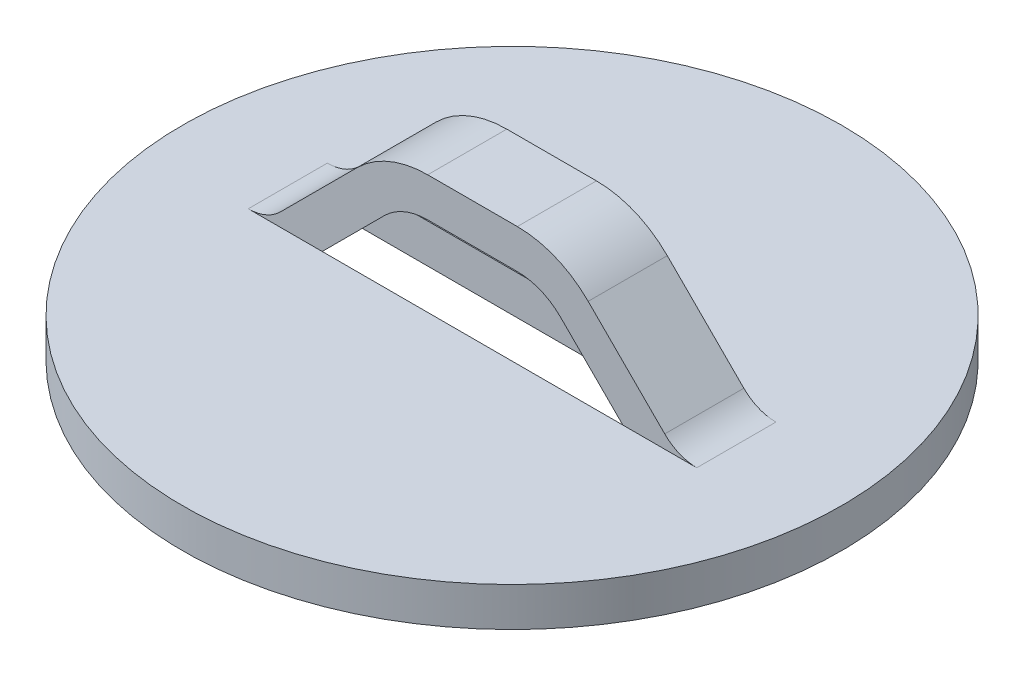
ISO-10303-21;
HEADER;
FILE_DESCRIPTION(('STEP AP214'),'2;1');
FILE_NAME('part.step','',(''),(''),'','','');
FILE_SCHEMA(('AUTOMOTIVE_DESIGN { 1 0 10303 214 1 1 1 1 }'));
ENDSEC;
DATA;
#1=APPLICATION_CONTEXT('core data for automotive mechanical design processes');
#2=APPLICATION_PROTOCOL_DEFINITION('international standard','automotive_design',2000,#1);
#3=PRODUCT_CONTEXT('',#1,'mechanical');
#4=PRODUCT('Part','Part','',(#3));
#5=PRODUCT_RELATED_PRODUCT_CATEGORY('part','',(#4));
#6=PRODUCT_DEFINITION_FORMATION('','',#4);
#7=PRODUCT_DEFINITION_CONTEXT('part definition',#1,'design');
#8=PRODUCT_DEFINITION('design','',#6,#7);
#9=PRODUCT_DEFINITION_SHAPE('','',#8);
#10=(LENGTH_UNIT() NAMED_UNIT(*) SI_UNIT(.MILLI.,.METRE.));
#11=(NAMED_UNIT(*) PLANE_ANGLE_UNIT() SI_UNIT($,.RADIAN.));
#12=(NAMED_UNIT(*) SI_UNIT($,.STERADIAN.) SOLID_ANGLE_UNIT());
#13=UNCERTAINTY_MEASURE_WITH_UNIT(LENGTH_MEASURE(1.E-05),#10,'distance_accuracy_value','');
#14=(GEOMETRIC_REPRESENTATION_CONTEXT(3) GLOBAL_UNCERTAINTY_ASSIGNED_CONTEXT((#13)) GLOBAL_UNIT_ASSIGNED_CONTEXT((#10,
#11,#12)) REPRESENTATION_CONTEXT('',''));
#15=CARTESIAN_POINT('',(0.,0.,0.));
#16=DIRECTION('',(0.,0.,1.));
#17=DIRECTION('',(1.,0.,0.));
#18=AXIS2_PLACEMENT_3D('',#15,#16,#17);
#19=CARTESIAN_POINT('',(-11.6166532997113,2.1844,3.81));
#20=DIRECTION('',(0.,0.,-1.));
#21=DIRECTION('',(-1.,0.,0.));
#22=AXIS2_PLACEMENT_3D('',#19,#20,#21);
#23=PLANE('',#22);
#24=DIRECTION('',(-1.,0.,0.));
#25=VECTOR('',#24,1.);
#26=CARTESIAN_POINT('',(-11.6166532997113,0.,3.81));
#27=LINE('',#26,#25);
#28=CARTESIAN_POINT('',(9.98975221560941,0.,3.81));
#29=VERTEX_POINT('',#28);
#30=CARTESIAN_POINT('',(6.42678829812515,0.,3.81));
#31=VERTEX_POINT('',#30);
#32=EDGE_CURVE('E343',#29,#31,#27,.T.);
#33=ORIENTED_EDGE('',*,*,#32,.F.);
#34=CARTESIAN_POINT('',(9.98975221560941,2.1844,3.81));
#35=DIRECTION('',(0.,0.,-1.));
#36=DIRECTION('',(1.,0.,0.));
#37=AXIS2_PLACEMENT_3D('',#34,#35,#36);
#38=CIRCLE('',#37,2.1844);
#39=CARTESIAN_POINT('',(8.44514816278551,0.639795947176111,3.81));
#40=VERTEX_POINT('',#39);
#41=EDGE_CURVE('E279',#29,#40,#38,.T.);
#42=ORIENTED_EDGE('',*,*,#41,.T.);
#43=DIRECTION('',(-0.707106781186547,0.707106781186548,0.));
#44=VECTOR('',#43,1.);
#45=CARTESIAN_POINT('',(8.44514816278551,0.639795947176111,3.81));
#46=LINE('',#45,#44);
#47=CARTESIAN_POINT('',(4.75804678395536,4.32689732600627,3.81));
#48=VERTEX_POINT('',#47);
#49=EDGE_CURVE('E281',#40,#48,#46,.T.);
#50=ORIENTED_EDGE('',*,*,#49,.T.);
#51=CARTESIAN_POINT('',(1.34554945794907,0.914400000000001,3.81));
#52=DIRECTION('',(0.,0.,1.));
#53=DIRECTION('',(-1.,0.,0.));
#54=AXIS2_PLACEMENT_3D('',#51,#52,#53);
#55=CIRCLE('',#54,4.826);
#56=CARTESIAN_POINT('',(1.34554945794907,5.7404,3.81));
#57=VERTEX_POINT('',#56);
#58=EDGE_CURVE('E283',#48,#57,#55,.T.);
#59=ORIENTED_EDGE('',*,*,#58,.T.);
#60=DIRECTION('',(-1.,0.,0.));
#61=VECTOR('',#60,1.);
#62=CARTESIAN_POINT('',(-2.97245054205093,5.7404,3.81));
#63=LINE('',#62,#61);
#64=CARTESIAN_POINT('',(-2.97245054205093,5.7404,3.81));
#65=VERTEX_POINT('',#64);
#66=EDGE_CURVE('E285',#57,#65,#63,.T.);
#67=ORIENTED_EDGE('',*,*,#66,.T.);
#68=CARTESIAN_POINT('',(-2.97245054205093,0.9144,3.81));
#69=DIRECTION('',(0.,0.,1.));
#70=DIRECTION('',(1.,0.,0.));
#71=AXIS2_PLACEMENT_3D('',#68,#69,#70);
#72=CIRCLE('',#71,4.826);
#73=CARTESIAN_POINT('',(-6.38494786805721,4.32689732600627,3.81));
#74=VERTEX_POINT('',#73);
#75=EDGE_CURVE('E287',#65,#74,#72,.T.);
#76=ORIENTED_EDGE('',*,*,#75,.T.);
#77=DIRECTION('',(-0.707106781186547,-0.707106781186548,0.));
#78=VECTOR('',#77,1.);
#79=CARTESIAN_POINT('',(-10.0720492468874,0.639795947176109,3.81));
#80=LINE('',#79,#78);
#81=CARTESIAN_POINT('',(-10.0720492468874,0.639795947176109,3.81));
#82=VERTEX_POINT('',#81);
#83=EDGE_CURVE('E197',#74,#82,#80,.T.);
#84=ORIENTED_EDGE('',*,*,#83,.T.);
#85=CARTESIAN_POINT('',(-11.6166532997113,2.1844,3.81));
#86=DIRECTION('',(0.,0.,-1.));
#87=DIRECTION('',(-1.,0.,0.));
#88=AXIS2_PLACEMENT_3D('',#85,#86,#87);
#89=CIRCLE('',#88,2.1844);
#90=CARTESIAN_POINT('',(-11.6166532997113,0.,3.81));
#91=VERTEX_POINT('',#90);
#92=EDGE_CURVE('E193',#82,#91,#89,.T.);
#93=ORIENTED_EDGE('',*,*,#92,.T.);
#94=CARTESIAN_POINT('',(-8.053689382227,0.,3.81));
#95=VERTEX_POINT('',#94);
#96=EDGE_CURVE('E60',#95,#91,#27,.T.);
#97=ORIENTED_EDGE('',*,*,#96,.F.);
#98=DIRECTION('',(0.707106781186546,0.707106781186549,0.));
#99=VECTOR('',#98,1.);
#100=CARTESIAN_POINT('',(-8.74297134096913,-0.689281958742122,3.81));
#101=LINE('',#100,#99);
#102=CARTESIAN_POINT('',(-5.05586996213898,2.99781942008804,3.81));
#103=VERTEX_POINT('',#102);
#104=EDGE_CURVE('E267',#95,#103,#101,.T.);
#105=ORIENTED_EDGE('',*,*,#104,.T.);
#106=CARTESIAN_POINT('',(-2.97245054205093,0.9144,3.81));
#107=DIRECTION('',(0.,0.,-1.));
#108=DIRECTION('',(1.,0.,0.));
#109=AXIS2_PLACEMENT_3D('',#106,#107,#108);
#110=CIRCLE('',#109,2.9464);
#111=CARTESIAN_POINT('',(-2.97245054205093,3.8608,3.81));
#112=VERTEX_POINT('',#111);
#113=EDGE_CURVE('E270',#103,#112,#110,.T.);
#114=ORIENTED_EDGE('',*,*,#113,.T.);
#115=DIRECTION('',(1.,0.,0.));
#116=VECTOR('',#115,1.);
#117=CARTESIAN_POINT('',(-2.97245054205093,3.8608,3.81));
#118=LINE('',#117,#116);
#119=CARTESIAN_POINT('',(1.34554945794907,3.8608,3.81));
#120=VERTEX_POINT('',#119);
#121=EDGE_CURVE('E272',#112,#120,#118,.T.);
#122=ORIENTED_EDGE('',*,*,#121,.T.);
#123=CARTESIAN_POINT('',(1.34554945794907,0.914400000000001,3.81));
#124=DIRECTION('',(0.,0.,-1.));
#125=DIRECTION('',(-1.,0.,0.));
#126=AXIS2_PLACEMENT_3D('',#123,#124,#125);
#127=CIRCLE('',#126,2.9464);
#128=CARTESIAN_POINT('',(3.42896887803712,2.99781942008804,3.81));
#129=VERTEX_POINT('',#128);
#130=EDGE_CURVE('E274',#120,#129,#127,.T.);
#131=ORIENTED_EDGE('',*,*,#130,.T.);
#132=DIRECTION('',(0.707106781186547,-0.707106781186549,0.));
#133=VECTOR('',#132,1.);
#134=CARTESIAN_POINT('',(7.11607025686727,-0.689281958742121,3.81));
#135=LINE('',#134,#133);
#136=EDGE_CURVE('E276',#129,#31,#135,.T.);
#137=ORIENTED_EDGE('',*,*,#136,.T.);
#138=EDGE_LOOP('',(#33,#42,#50,#59,#67,#76,#84,#93,#97,#105,#114,#122,#131,#137));
#139=FACE_BOUND('',#138,.T.);
#140=ADVANCED_FACE('F37',(#139),#23,.F.);
#141=CARTESIAN_POINT('',(-11.6166532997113,2.1844,0.));
#142=DIRECTION('',(0.,0.,-1.));
#143=DIRECTION('',(-1.,0.,0.));
#144=AXIS2_PLACEMENT_3D('',#141,#142,#143);
#145=PLANE('',#144);
#146=CARTESIAN_POINT('',(9.98975221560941,2.1844,0.));
#147=DIRECTION('',(0.,0.,-1.));
#148=DIRECTION('',(1.,0.,0.));
#149=AXIS2_PLACEMENT_3D('',#146,#147,#148);
#150=CIRCLE('',#149,2.1844);
#151=CARTESIAN_POINT('',(9.98975221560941,0.,0.));
#152=VERTEX_POINT('',#151);
#153=CARTESIAN_POINT('',(8.44514816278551,0.639795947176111,0.));
#154=VERTEX_POINT('',#153);
#155=EDGE_CURVE('E306',#152,#154,#150,.T.);
#156=ORIENTED_EDGE('',*,*,#155,.F.);
#157=DIRECTION('',(-1.,0.,0.));
#158=VECTOR('',#157,1.);
#159=CARTESIAN_POINT('',(-11.6166532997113,0.,0.));
#160=LINE('',#159,#158);
#161=CARTESIAN_POINT('',(6.42678829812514,0.,0.));
#162=VERTEX_POINT('',#161);
#163=EDGE_CURVE('E11',#152,#162,#160,.T.);
#164=ORIENTED_EDGE('',*,*,#163,.T.);
#165=DIRECTION('',(0.707106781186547,-0.707106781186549,0.));
#166=VECTOR('',#165,1.);
#167=CARTESIAN_POINT('',(7.11607025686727,-0.689281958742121,0.));
#168=LINE('',#167,#166);
#169=CARTESIAN_POINT('',(3.42896887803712,2.99781942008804,0.));
#170=VERTEX_POINT('',#169);
#171=EDGE_CURVE('E300',#170,#162,#168,.T.);
#172=ORIENTED_EDGE('',*,*,#171,.F.);
#173=CARTESIAN_POINT('',(1.34554945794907,0.914400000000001,0.));
#174=DIRECTION('',(0.,0.,-1.));
#175=DIRECTION('',(-1.,0.,0.));
#176=AXIS2_PLACEMENT_3D('',#173,#174,#175);
#177=CIRCLE('',#176,2.9464);
#178=CARTESIAN_POINT('',(1.34554945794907,3.8608,0.));
#179=VERTEX_POINT('',#178);
#180=EDGE_CURVE('E297',#179,#170,#177,.T.);
#181=ORIENTED_EDGE('',*,*,#180,.F.);
#182=DIRECTION('',(1.,0.,0.));
#183=VECTOR('',#182,1.);
#184=CARTESIAN_POINT('',(-2.97245054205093,3.8608,0.));
#185=LINE('',#184,#183);
#186=CARTESIAN_POINT('',(-2.97245054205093,3.8608,0.));
#187=VERTEX_POINT('',#186);
#188=EDGE_CURVE('E295',#187,#179,#185,.T.);
#189=ORIENTED_EDGE('',*,*,#188,.F.);
#190=CARTESIAN_POINT('',(-2.97245054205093,0.9144,0.));
#191=DIRECTION('',(0.,0.,-1.));
#192=DIRECTION('',(1.,0.,0.));
#193=AXIS2_PLACEMENT_3D('',#190,#191,#192);
#194=CIRCLE('',#193,2.9464);
#195=CARTESIAN_POINT('',(-5.05586996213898,2.99781942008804,0.));
#196=VERTEX_POINT('',#195);
#197=EDGE_CURVE('E293',#196,#187,#194,.T.);
#198=ORIENTED_EDGE('',*,*,#197,.F.);
#199=DIRECTION('',(0.707106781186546,0.707106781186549,0.));
#200=VECTOR('',#199,1.);
#201=CARTESIAN_POINT('',(-8.74297134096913,-0.689281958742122,0.));
#202=LINE('',#201,#200);
#203=CARTESIAN_POINT('',(-8.05368938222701,0.,0.));
#204=VERTEX_POINT('',#203);
#205=EDGE_CURVE('E171',#204,#196,#202,.T.);
#206=ORIENTED_EDGE('',*,*,#205,.F.);
#207=DIRECTION('',(1.,0.,0.));
#208=VECTOR('',#207,1.);
#209=CARTESIAN_POINT('',(-11.6166532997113,0.,0.));
#210=LINE('',#209,#208);
#211=CARTESIAN_POINT('',(-11.6166532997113,0.,0.));
#212=VERTEX_POINT('',#211);
#213=EDGE_CURVE('E164',#212,#204,#210,.T.);
#214=ORIENTED_EDGE('',*,*,#213,.F.);
#215=CARTESIAN_POINT('',(-11.6166532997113,2.1844,0.));
#216=DIRECTION('',(0.,0.,-1.));
#217=DIRECTION('',(-1.,0.,0.));
#218=AXIS2_PLACEMENT_3D('',#215,#216,#217);
#219=CIRCLE('',#218,2.1844);
#220=CARTESIAN_POINT('',(-10.0720492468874,0.639795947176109,0.));
#221=VERTEX_POINT('',#220);
#222=EDGE_CURVE('E169',#221,#212,#219,.T.);
#223=ORIENTED_EDGE('',*,*,#222,.F.);
#224=DIRECTION('',(-0.707106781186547,-0.707106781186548,0.));
#225=VECTOR('',#224,1.);
#226=CARTESIAN_POINT('',(-10.0720492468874,0.639795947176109,0.));
#227=LINE('',#226,#225);
#228=CARTESIAN_POINT('',(-6.38494786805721,4.32689732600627,0.));
#229=VERTEX_POINT('',#228);
#230=EDGE_CURVE('E188',#229,#221,#227,.T.);
#231=ORIENTED_EDGE('',*,*,#230,.F.);
#232=CARTESIAN_POINT('',(-2.97245054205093,0.9144,0.));
#233=DIRECTION('',(0.,0.,1.));
#234=DIRECTION('',(1.,0.,0.));
#235=AXIS2_PLACEMENT_3D('',#232,#233,#234);
#236=CIRCLE('',#235,4.826);
#237=CARTESIAN_POINT('',(-2.97245054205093,5.7404,0.));
#238=VERTEX_POINT('',#237);
#239=EDGE_CURVE('E314',#238,#229,#236,.T.);
#240=ORIENTED_EDGE('',*,*,#239,.F.);
#241=DIRECTION('',(-1.,0.,0.));
#242=VECTOR('',#241,1.);
#243=CARTESIAN_POINT('',(-2.97245054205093,5.7404,0.));
#244=LINE('',#243,#242);
#245=CARTESIAN_POINT('',(1.34554945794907,5.7404,0.));
#246=VERTEX_POINT('',#245);
#247=EDGE_CURVE('E312',#246,#238,#244,.T.);
#248=ORIENTED_EDGE('',*,*,#247,.F.);
#249=CARTESIAN_POINT('',(1.34554945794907,0.914400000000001,0.));
#250=DIRECTION('',(0.,0.,1.));
#251=DIRECTION('',(-1.,0.,0.));
#252=AXIS2_PLACEMENT_3D('',#249,#250,#251);
#253=CIRCLE('',#252,4.826);
#254=CARTESIAN_POINT('',(4.75804678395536,4.32689732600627,0.));
#255=VERTEX_POINT('',#254);
#256=EDGE_CURVE('E310',#255,#246,#253,.T.);
#257=ORIENTED_EDGE('',*,*,#256,.F.);
#258=DIRECTION('',(-0.707106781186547,0.707106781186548,0.));
#259=VECTOR('',#258,1.);
#260=CARTESIAN_POINT('',(8.44514816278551,0.639795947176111,0.));
#261=LINE('',#260,#259);
#262=EDGE_CURVE('E308',#154,#255,#261,.T.);
#263=ORIENTED_EDGE('',*,*,#262,.F.);
#264=EDGE_LOOP('',(#156,#164,#172,#181,#189,#198,#206,#214,#223,#231,#240,#248,#257,#263));
#265=FACE_BOUND('',#264,.T.);
#266=ADVANCED_FACE('F167',(#265),#145,.T.);
#267=CARTESIAN_POINT('',(-11.6166532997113,2.1844,3.81));
#268=DIRECTION('',(0.,0.,-1.));
#269=DIRECTION('',(-1.,0.,0.));
#270=AXIS2_PLACEMENT_3D('',#267,#268,#269);
#271=CYLINDRICAL_SURFACE('',#270,4.064);
#272=CARTESIAN_POINT('',(-11.6166532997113,2.1844,0.));
#273=DIRECTION('',(0.,0.,1.));
#274=DIRECTION('',(-1.,0.,0.));
#275=AXIS2_PLACEMENT_3D('',#272,#273,#274);
#276=CIRCLE('',#275,4.064);
#277=CARTESIAN_POINT('',(-11.6166532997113,-1.8796,0.));
#278=VERTEX_POINT('',#277);
#279=CARTESIAN_POINT('',(-8.74297134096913,-0.689281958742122,0.));
#280=VERTEX_POINT('',#279);
#281=EDGE_CURVE('E243',#278,#280,#276,.T.);
#282=ORIENTED_EDGE('',*,*,#281,.T.);
#283=DIRECTION('',(0.,0.,-1.));
#284=VECTOR('',#283,1.);
#285=CARTESIAN_POINT('',(-8.74297134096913,-0.689281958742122,3.81));
#286=LINE('',#285,#284);
#287=CARTESIAN_POINT('',(-8.74297134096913,-0.689281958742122,3.81));
#288=VERTEX_POINT('',#287);
#289=EDGE_CURVE('E236',#288,#280,#286,.T.);
#290=ORIENTED_EDGE('',*,*,#289,.F.);
#291=CARTESIAN_POINT('',(-11.6166532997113,2.1844,3.81));
#292=DIRECTION('',(0.,0.,1.));
#293=DIRECTION('',(-1.,0.,0.));
#294=AXIS2_PLACEMENT_3D('',#291,#292,#293);
#295=CIRCLE('',#294,4.064);
#296=CARTESIAN_POINT('',(-11.6166532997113,-1.8796,3.81));
#297=VERTEX_POINT('',#296);
#298=EDGE_CURVE('E187',#297,#288,#295,.T.);
#299=ORIENTED_EDGE('',*,*,#298,.F.);
#300=DIRECTION('',(0.,0.,-1.));
#301=VECTOR('',#300,1.);
#302=CARTESIAN_POINT('',(-11.6166532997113,-1.8796,3.81));
#303=LINE('',#302,#301);
#304=EDGE_CURVE('E45',#297,#278,#303,.T.);
#305=ORIENTED_EDGE('',*,*,#304,.T.);
#306=EDGE_LOOP('',(#282,#290,#299,#305));
#307=FACE_BOUND('',#306,.T.);
#308=ADVANCED_FACE('F39',(#307),#271,.T.);
#309=CARTESIAN_POINT('',(-8.74297134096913,-0.689281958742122,3.81));
#310=DIRECTION('',(-0.707106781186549,0.707106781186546,0.));
#311=DIRECTION('',(-0.707106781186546,-0.707106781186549,0.));
#312=AXIS2_PLACEMENT_3D('',#309,#310,#311);
#313=PLANE('',#312);
#314=EDGE_CURVE('E291',#280,#204,#202,.T.);
#315=ORIENTED_EDGE('',*,*,#314,.T.);
#316=ORIENTED_EDGE('',*,*,#205,.T.);
#317=DIRECTION('',(0.,0.,-1.));
#318=VECTOR('',#317,1.);
#319=CARTESIAN_POINT('',(-5.05586996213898,2.99781942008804,3.81));
#320=LINE('',#319,#318);
#321=EDGE_CURVE('E233',#103,#196,#320,.T.);
#322=ORIENTED_EDGE('',*,*,#321,.F.);
#323=ORIENTED_EDGE('',*,*,#104,.F.);
#324=EDGE_CURVE('E268',#288,#95,#101,.T.);
#325=ORIENTED_EDGE('',*,*,#324,.F.);
#326=ORIENTED_EDGE('',*,*,#289,.T.);
#327=EDGE_LOOP('',(#315,#316,#322,#323,#325,#326));
#328=FACE_BOUND('',#327,.T.);
#329=ADVANCED_FACE('F363',(#328),#313,.F.);
#330=CARTESIAN_POINT('',(-2.97245054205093,0.9144,3.81));
#331=DIRECTION('',(0.,0.,-1.));
#332=DIRECTION('',(-1.,0.,0.));
#333=AXIS2_PLACEMENT_3D('',#330,#331,#332);
#334=CYLINDRICAL_SURFACE('',#333,2.9464);
#335=ORIENTED_EDGE('',*,*,#197,.T.);
#336=DIRECTION('',(0.,0.,-1.));
#337=VECTOR('',#336,1.);
#338=CARTESIAN_POINT('',(-2.97245054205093,3.8608,3.81));
#339=LINE('',#338,#337);
#340=EDGE_CURVE('E230',#112,#187,#339,.T.);
#341=ORIENTED_EDGE('',*,*,#340,.F.);
#342=ORIENTED_EDGE('',*,*,#113,.F.);
#343=ORIENTED_EDGE('',*,*,#321,.T.);
#344=EDGE_LOOP('',(#335,#341,#342,#343));
#345=FACE_BOUND('',#344,.T.);
#346=ADVANCED_FACE('F360',(#345),#334,.F.);
#347=CARTESIAN_POINT('',(-2.97245054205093,3.8608,3.81));
#348=DIRECTION('',(0.,1.,0.));
#349=DIRECTION('',(0.,0.,1.));
#350=AXIS2_PLACEMENT_3D('',#347,#348,#349);
#351=PLANE('',#350);
#352=ORIENTED_EDGE('',*,*,#188,.T.);
#353=DIRECTION('',(0.,0.,-1.));
#354=VECTOR('',#353,1.);
#355=CARTESIAN_POINT('',(1.34554945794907,3.8608,3.81));
#356=LINE('',#355,#354);
#357=EDGE_CURVE('E227',#120,#179,#356,.T.);
#358=ORIENTED_EDGE('',*,*,#357,.F.);
#359=ORIENTED_EDGE('',*,*,#121,.F.);
#360=ORIENTED_EDGE('',*,*,#340,.T.);
#361=EDGE_LOOP('',(#352,#358,#359,#360));
#362=FACE_BOUND('',#361,.T.);
#363=ADVANCED_FACE('F355',(#362),#351,.F.);
#364=CARTESIAN_POINT('',(1.34554945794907,0.914400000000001,3.81));
#365=DIRECTION('',(0.,0.,-1.));
#366=DIRECTION('',(-1.,0.,0.));
#367=AXIS2_PLACEMENT_3D('',#364,#365,#366);
#368=CYLINDRICAL_SURFACE('',#367,2.9464);
#369=ORIENTED_EDGE('',*,*,#180,.T.);
#370=DIRECTION('',(0.,0.,-1.));
#371=VECTOR('',#370,1.);
#372=CARTESIAN_POINT('',(3.42896887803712,2.99781942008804,3.81));
#373=LINE('',#372,#371);
#374=EDGE_CURVE('E224',#129,#170,#373,.T.);
#375=ORIENTED_EDGE('',*,*,#374,.F.);
#376=ORIENTED_EDGE('',*,*,#130,.F.);
#377=ORIENTED_EDGE('',*,*,#357,.T.);
#378=EDGE_LOOP('',(#369,#375,#376,#377));
#379=FACE_BOUND('',#378,.T.);
#380=ADVANCED_FACE('F351',(#379),#368,.F.);
#381=CARTESIAN_POINT('',(7.11607025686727,-0.689281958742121,3.81));
#382=DIRECTION('',(0.707106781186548,0.707106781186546,0.));
#383=DIRECTION('',(-0.707106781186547,0.707106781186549,0.));
#384=AXIS2_PLACEMENT_3D('',#381,#382,#383);
#385=PLANE('',#384);
#386=ORIENTED_EDGE('',*,*,#171,.T.);
#387=CARTESIAN_POINT('',(7.11607025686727,-0.689281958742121,0.));
#388=VERTEX_POINT('',#387);
#389=EDGE_CURVE('E299',#162,#388,#168,.T.);
#390=ORIENTED_EDGE('',*,*,#389,.T.);
#391=DIRECTION('',(0.,0.,-1.));
#392=VECTOR('',#391,1.);
#393=CARTESIAN_POINT('',(7.11607025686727,-0.689281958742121,3.81));
#394=LINE('',#393,#392);
#395=CARTESIAN_POINT('',(7.11607025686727,-0.689281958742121,3.81));
#396=VERTEX_POINT('',#395);
#397=EDGE_CURVE('E221',#396,#388,#394,.T.);
#398=ORIENTED_EDGE('',*,*,#397,.F.);
#399=EDGE_CURVE('E52',#31,#396,#135,.T.);
#400=ORIENTED_EDGE('',*,*,#399,.F.);
#401=ORIENTED_EDGE('',*,*,#136,.F.);
#402=ORIENTED_EDGE('',*,*,#374,.T.);
#403=EDGE_LOOP('',(#386,#390,#398,#400,#401,#402));
#404=FACE_BOUND('',#403,.T.);
#405=ADVANCED_FACE('F347',(#404),#385,.F.);
#406=CARTESIAN_POINT('',(9.98975221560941,2.1844,3.81));
#407=DIRECTION('',(0.,0.,-1.));
#408=DIRECTION('',(-1.,0.,0.));
#409=AXIS2_PLACEMENT_3D('',#406,#407,#408);
#410=CYLINDRICAL_SURFACE('',#409,4.064);
#411=CARTESIAN_POINT('',(9.98975221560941,2.1844,0.));
#412=DIRECTION('',(0.,0.,1.));
#413=DIRECTION('',(1.,0.,0.));
#414=AXIS2_PLACEMENT_3D('',#411,#412,#413);
#415=CIRCLE('',#414,4.064);
#416=CARTESIAN_POINT('',(9.98975221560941,-1.8796,0.));
#417=VERTEX_POINT('',#416);
#418=EDGE_CURVE('E303',#388,#417,#415,.T.);
#419=ORIENTED_EDGE('',*,*,#418,.T.);
#420=DIRECTION('',(0.,0.,-1.));
#421=VECTOR('',#420,1.);
#422=CARTESIAN_POINT('',(9.98975221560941,-1.8796,3.81));
#423=LINE('',#422,#421);
#424=CARTESIAN_POINT('',(9.98975221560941,-1.8796,3.81));
#425=VERTEX_POINT('',#424);
#426=EDGE_CURVE('E218',#425,#417,#423,.T.);
#427=ORIENTED_EDGE('',*,*,#426,.F.);
#428=CARTESIAN_POINT('',(9.98975221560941,2.1844,3.81));
#429=DIRECTION('',(0.,0.,1.));
#430=DIRECTION('',(1.,0.,0.));
#431=AXIS2_PLACEMENT_3D('',#428,#429,#430);
#432=CIRCLE('',#431,4.064);
#433=EDGE_CURVE('E256',#396,#425,#432,.T.);
#434=ORIENTED_EDGE('',*,*,#433,.F.);
#435=ORIENTED_EDGE('',*,*,#397,.T.);
#436=EDGE_LOOP('',(#419,#427,#434,#435));
#437=FACE_BOUND('',#436,.T.);
#438=ADVANCED_FACE('F370',(#437),#410,.T.);
#439=CARTESIAN_POINT('',(9.98975221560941,-1.8796,3.81));
#440=DIRECTION('',(0.,1.,0.));
#441=DIRECTION('',(0.,0.,1.));
#442=AXIS2_PLACEMENT_3D('',#439,#440,#441);
#443=PLANE('',#442);
#444=CARTESIAN_POINT('',(-0.813450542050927,-1.8796,1.905));
#445=DIRECTION('',(0.,-1.,0.));
#446=DIRECTION('',(0.,0.,-1.));
#447=AXIS2_PLACEMENT_3D('',#444,#445,#446);
#448=CIRCLE('',#447,15.875);
#449=CARTESIAN_POINT('',(-0.813450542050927,-1.8796,-13.97));
#450=VERTEX_POINT('',#449);
#451=EDGE_CURVE('E176',#450,#450,#448,.T.);
#452=ORIENTED_EDGE('',*,*,#451,.T.);
#453=EDGE_LOOP('',(#452));
#454=FACE_BOUND('',#453,.T.);
#455=DIRECTION('',(-1.,0.,0.));
#456=VECTOR('',#455,1.);
#457=CARTESIAN_POINT('',(-11.6166532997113,-1.8796,3.81));
#458=LINE('',#457,#456);
#459=EDGE_CURVE('E249',#425,#297,#458,.T.);
#460=ORIENTED_EDGE('',*,*,#459,.F.);
#461=ORIENTED_EDGE('',*,*,#426,.T.);
#462=DIRECTION('',(1.,0.,0.));
#463=VECTOR('',#462,1.);
#464=CARTESIAN_POINT('',(-11.6166532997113,-1.8796,0.));
#465=LINE('',#464,#463);
#466=EDGE_CURVE('E250',#278,#417,#465,.T.);
#467=ORIENTED_EDGE('',*,*,#466,.F.);
#468=ORIENTED_EDGE('',*,*,#304,.F.);
#469=EDGE_LOOP('',(#460,#461,#467,#468));
#470=FACE_BOUND('',#469,.T.);
#471=ADVANCED_FACE('F248',(#454,#470),#443,.F.);
#472=CARTESIAN_POINT('',(9.98975221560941,2.1844,3.81));
#473=DIRECTION('',(0.,0.,-1.));
#474=DIRECTION('',(-1.,0.,0.));
#475=AXIS2_PLACEMENT_3D('',#472,#473,#474);
#476=CYLINDRICAL_SURFACE('',#475,2.1844);
#477=ORIENTED_EDGE('',*,*,#155,.T.);
#478=DIRECTION('',(0.,0.,-1.));
#479=VECTOR('',#478,1.);
#480=CARTESIAN_POINT('',(8.44514816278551,0.639795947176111,3.81));
#481=LINE('',#480,#479);
#482=EDGE_CURVE('E212',#40,#154,#481,.T.);
#483=ORIENTED_EDGE('',*,*,#482,.F.);
#484=ORIENTED_EDGE('',*,*,#41,.F.);
#485=DIRECTION('',(0.,0.,-1.));
#486=VECTOR('',#485,1.);
#487=CARTESIAN_POINT('',(9.98975221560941,0.,3.81));
#488=LINE('',#487,#486);
#489=EDGE_CURVE('E215',#29,#152,#488,.T.);
#490=ORIENTED_EDGE('',*,*,#489,.T.);
#491=EDGE_LOOP('',(#477,#483,#484,#490));
#492=FACE_BOUND('',#491,.T.);
#493=ADVANCED_FACE('F341',(#492),#476,.F.);
#494=CARTESIAN_POINT('',(8.44514816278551,0.639795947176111,3.81));
#495=DIRECTION('',(-0.707106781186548,-0.707106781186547,0.));
#496=DIRECTION('',(0.707106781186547,-0.707106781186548,0.));
#497=AXIS2_PLACEMENT_3D('',#494,#495,#496);
#498=PLANE('',#497);
#499=ORIENTED_EDGE('',*,*,#262,.T.);
#500=DIRECTION('',(0.,0.,-1.));
#501=VECTOR('',#500,1.);
#502=CARTESIAN_POINT('',(4.75804678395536,4.32689732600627,3.81));
#503=LINE('',#502,#501);
#504=EDGE_CURVE('E209',#48,#255,#503,.T.);
#505=ORIENTED_EDGE('',*,*,#504,.F.);
#506=ORIENTED_EDGE('',*,*,#49,.F.);
#507=ORIENTED_EDGE('',*,*,#482,.T.);
#508=EDGE_LOOP('',(#499,#505,#506,#507));
#509=FACE_BOUND('',#508,.T.);
#510=ADVANCED_FACE('F336',(#509),#498,.F.);
#511=CARTESIAN_POINT('',(1.34554945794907,0.914400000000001,3.81));
#512=DIRECTION('',(0.,0.,-1.));
#513=DIRECTION('',(-1.,0.,0.));
#514=AXIS2_PLACEMENT_3D('',#511,#512,#513);
#515=CYLINDRICAL_SURFACE('',#514,4.826);
#516=ORIENTED_EDGE('',*,*,#256,.T.);
#517=DIRECTION('',(0.,0.,-1.));
#518=VECTOR('',#517,1.);
#519=CARTESIAN_POINT('',(1.34554945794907,5.7404,3.81));
#520=LINE('',#519,#518);
#521=EDGE_CURVE('E206',#57,#246,#520,.T.);
#522=ORIENTED_EDGE('',*,*,#521,.F.);
#523=ORIENTED_EDGE('',*,*,#58,.F.);
#524=ORIENTED_EDGE('',*,*,#504,.T.);
#525=EDGE_LOOP('',(#516,#522,#523,#524));
#526=FACE_BOUND('',#525,.T.);
#527=ADVANCED_FACE('F332',(#526),#515,.T.);
#528=CARTESIAN_POINT('',(-2.97245054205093,5.7404,3.81));
#529=DIRECTION('',(0.,-1.,0.));
#530=DIRECTION('',(1.,0.,0.));
#531=AXIS2_PLACEMENT_3D('',#528,#529,#530);
#532=PLANE('',#531);
#533=ORIENTED_EDGE('',*,*,#247,.T.);
#534=DIRECTION('',(0.,0.,-1.));
#535=VECTOR('',#534,1.);
#536=CARTESIAN_POINT('',(-2.97245054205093,5.7404,3.81));
#537=LINE('',#536,#535);
#538=EDGE_CURVE('E203',#65,#238,#537,.T.);
#539=ORIENTED_EDGE('',*,*,#538,.F.);
#540=ORIENTED_EDGE('',*,*,#66,.F.);
#541=ORIENTED_EDGE('',*,*,#521,.T.);
#542=EDGE_LOOP('',(#533,#539,#540,#541));
#543=FACE_BOUND('',#542,.T.);
#544=ADVANCED_FACE('F328',(#543),#532,.F.);
#545=CARTESIAN_POINT('',(-2.97245054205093,0.9144,3.81));
#546=DIRECTION('',(0.,0.,-1.));
#547=DIRECTION('',(-1.,0.,0.));
#548=AXIS2_PLACEMENT_3D('',#545,#546,#547);
#549=CYLINDRICAL_SURFACE('',#548,4.826);
#550=ORIENTED_EDGE('',*,*,#239,.T.);
#551=DIRECTION('',(0.,0.,-1.));
#552=VECTOR('',#551,1.);
#553=CARTESIAN_POINT('',(-6.38494786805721,4.32689732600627,3.81));
#554=LINE('',#553,#552);
#555=EDGE_CURVE('E195',#74,#229,#554,.T.);
#556=ORIENTED_EDGE('',*,*,#555,.F.);
#557=ORIENTED_EDGE('',*,*,#75,.F.);
#558=ORIENTED_EDGE('',*,*,#538,.T.);
#559=EDGE_LOOP('',(#550,#556,#557,#558));
#560=FACE_BOUND('',#559,.T.);
#561=ADVANCED_FACE('F323',(#560),#549,.T.);
#562=CARTESIAN_POINT('',(-10.0720492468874,0.639795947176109,3.81));
#563=DIRECTION('',(0.707106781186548,-0.707106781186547,0.));
#564=DIRECTION('',(0.707106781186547,0.707106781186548,0.));
#565=AXIS2_PLACEMENT_3D('',#562,#563,#564);
#566=PLANE('',#565);
#567=ORIENTED_EDGE('',*,*,#230,.T.);
#568=DIRECTION('',(0.,0.,-1.));
#569=VECTOR('',#568,1.);
#570=CARTESIAN_POINT('',(-10.0720492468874,0.639795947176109,3.81));
#571=LINE('',#570,#569);
#572=EDGE_CURVE('E186',#82,#221,#571,.T.);
#573=ORIENTED_EDGE('',*,*,#572,.F.);
#574=ORIENTED_EDGE('',*,*,#83,.F.);
#575=ORIENTED_EDGE('',*,*,#555,.T.);
#576=EDGE_LOOP('',(#567,#573,#574,#575));
#577=FACE_BOUND('',#576,.T.);
#578=ADVANCED_FACE('F316',(#577),#566,.F.);
#579=CARTESIAN_POINT('',(-11.6166532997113,2.1844,3.81));
#580=DIRECTION('',(0.,0.,-1.));
#581=DIRECTION('',(-1.,0.,0.));
#582=AXIS2_PLACEMENT_3D('',#579,#580,#581);
#583=CYLINDRICAL_SURFACE('',#582,2.1844);
#584=ORIENTED_EDGE('',*,*,#222,.T.);
#585=DIRECTION('',(0.,0.,-1.));
#586=VECTOR('',#585,1.);
#587=CARTESIAN_POINT('',(-11.6166532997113,0.,3.81));
#588=LINE('',#587,#586);
#589=EDGE_CURVE('E184',#91,#212,#588,.T.);
#590=ORIENTED_EDGE('',*,*,#589,.F.);
#591=ORIENTED_EDGE('',*,*,#92,.F.);
#592=ORIENTED_EDGE('',*,*,#572,.T.);
#593=EDGE_LOOP('',(#584,#590,#591,#592));
#594=FACE_BOUND('',#593,.T.);
#595=ADVANCED_FACE('F182',(#594),#583,.F.);
#596=CARTESIAN_POINT('',(-16.6884505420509,0.,3.81));
#597=DIRECTION('',(0.,-1.,0.));
#598=DIRECTION('',(0.,0.,-1.));
#599=AXIS2_PLACEMENT_3D('',#596,#597,#598);
#600=PLANE('',#599);
#601=CARTESIAN_POINT('',(-0.813450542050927,0.,1.905));
#602=DIRECTION('',(0.,-1.,0.));
#603=DIRECTION('',(0.,0.,-1.));
#604=AXIS2_PLACEMENT_3D('',#601,#602,#603);
#605=CIRCLE('',#604,15.875);
#606=CARTESIAN_POINT('',(-0.813450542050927,0.,-13.97));
#607=VERTEX_POINT('',#606);
#608=EDGE_CURVE('E261',#607,#607,#605,.T.);
#609=ORIENTED_EDGE('',*,*,#608,.F.);
#610=EDGE_LOOP('',(#609));
#611=FACE_BOUND('',#610,.T.);
#612=ORIENTED_EDGE('',*,*,#489,.F.);
#613=ORIENTED_EDGE('',*,*,#32,.T.);
#614=EDGE_CURVE('E367',#31,#95,#27,.T.);
#615=ORIENTED_EDGE('',*,*,#614,.T.);
#616=ORIENTED_EDGE('',*,*,#96,.T.);
#617=ORIENTED_EDGE('',*,*,#589,.T.);
#618=ORIENTED_EDGE('',*,*,#213,.T.);
#619=EDGE_CURVE('E177',#204,#162,#210,.T.);
#620=ORIENTED_EDGE('',*,*,#619,.T.);
#621=ORIENTED_EDGE('',*,*,#163,.F.);
#622=EDGE_LOOP('',(#612,#613,#615,#616,#617,#618,#620,#621));
#623=FACE_BOUND('',#622,.T.);
#624=ADVANCED_FACE('F191',(#611,#623),#600,.F.);
#625=CARTESIAN_POINT('',(-0.813450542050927,0.,1.905));
#626=DIRECTION('',(0.,-1.,0.));
#627=DIRECTION('',(0.,0.,-1.));
#628=AXIS2_PLACEMENT_3D('',#625,#626,#627);
#629=CYLINDRICAL_SURFACE('',#628,15.875);
#630=ORIENTED_EDGE('',*,*,#451,.F.);
#631=EDGE_LOOP('',(#630));
#632=FACE_BOUND('',#631,.T.);
#633=ORIENTED_EDGE('',*,*,#608,.T.);
#634=EDGE_LOOP('',(#633));
#635=FACE_BOUND('',#634,.T.);
#636=ADVANCED_FACE('F387',(#632,#635),#629,.T.);
#637=CARTESIAN_POINT('',(-11.6166532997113,0.,0.));
#638=DIRECTION('',(0.,0.,-1.));
#639=DIRECTION('',(-1.,0.,0.));
#640=AXIS2_PLACEMENT_3D('',#637,#638,#639);
#641=PLANE('',#640);
#642=ORIENTED_EDGE('',*,*,#314,.F.);
#643=ORIENTED_EDGE('',*,*,#281,.F.);
#644=ORIENTED_EDGE('',*,*,#466,.T.);
#645=ORIENTED_EDGE('',*,*,#418,.F.);
#646=ORIENTED_EDGE('',*,*,#389,.F.);
#647=ORIENTED_EDGE('',*,*,#619,.F.);
#648=EDGE_LOOP('',(#642,#643,#644,#645,#646,#647));
#649=FACE_BOUND('',#648,.T.);
#650=ADVANCED_FACE('F366',(#649),#641,.F.);
#651=CARTESIAN_POINT('',(-11.6166532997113,0.,3.81));
#652=DIRECTION('',(0.,0.,1.));
#653=DIRECTION('',(1.,0.,0.));
#654=AXIS2_PLACEMENT_3D('',#651,#652,#653);
#655=PLANE('',#654);
#656=ORIENTED_EDGE('',*,*,#459,.T.);
#657=ORIENTED_EDGE('',*,*,#298,.T.);
#658=ORIENTED_EDGE('',*,*,#324,.T.);
#659=ORIENTED_EDGE('',*,*,#614,.F.);
#660=ORIENTED_EDGE('',*,*,#399,.T.);
#661=ORIENTED_EDGE('',*,*,#433,.T.);
#662=EDGE_LOOP('',(#656,#657,#658,#659,#660,#661));
#663=FACE_BOUND('',#662,.T.);
#664=ADVANCED_FACE('F253',(#663),#655,.F.);
#665=CLOSED_SHELL('',(#140,#266,#308,#329,#346,#363,#380,#405,#438,#471,#493,#510,#527,#544,
#561,#578,#595,#624,#636,#650,#664));
#666=MANIFOLD_SOLID_BREP('B2',#665);
#667=ADVANCED_BREP_SHAPE_REPRESENTATION('',(#18,#666),#14);
#668=SHAPE_DEFINITION_REPRESENTATION(#9,#667);
ENDSEC;
END-ISO-10303-21;
